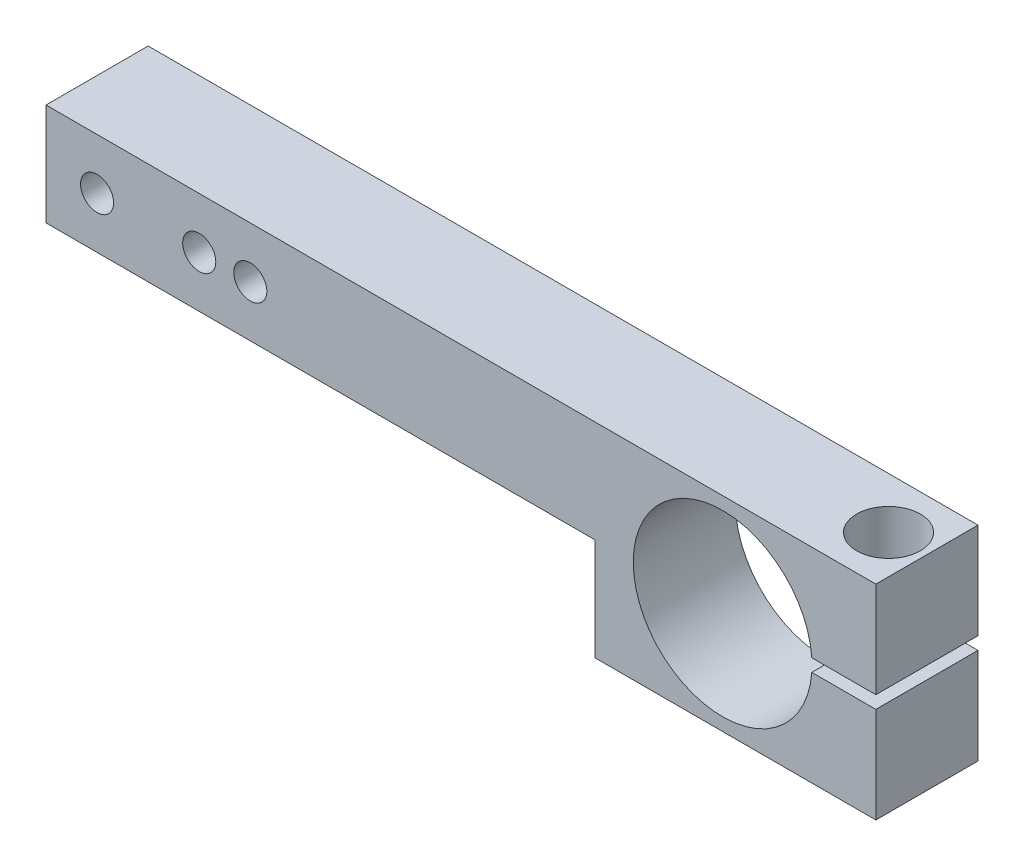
from build123d import *

# Parameters (mm, degrees)
SKETCH2_R                                       = 11.1125
SKETCH2_R_2                                     = 2.0574
BOSS_EXTRUDE1_DEPTH                             = 6.35
CBORE_FOR_10_SOCKET_HEAD_CAP_SCREW1_D           = 4.7752
CBORE_FOR_10_SOCKET_HEAD_CAP_SCREW1_CBORE_D     = 7.9248
CBORE_FOR_10_SOCKET_HEAD_CAP_SCREW1_CBORE_DEPTH = 6.35
CUT_EXTRUDE_THIN1_DEPTH                         = 86.31467913
CUT_EXTRUDE_THIN1_DEPTH_BACK                    = 86.31467913


with BuildPart() as part:
    # Sketch2 → Boss-Extrude1 (new, symmetric)
    with BuildSketch(Plane.XY):
        Polygon((19.05, 0), (19.05, 12.7), (-84.1248, 12.7), (-84.1248, 0), (-15.875, 0), (-15.875, -12.7), (19.05, -12.7), align=None)
        Circle(SKETCH2_R, mode=Mode.SUBTRACT)
        with Locations((-77.7748, 6.35)):
            Circle(SKETCH2_R_2, mode=Mode.SUBTRACT)
        with Locations((-58.7248, 6.35)):
            Circle(SKETCH2_R_2, mode=Mode.SUBTRACT)
        with Locations((-65.0748, 6.35)):
            Circle(SKETCH2_R_2, mode=Mode.SUBTRACT)
    extrude(amount=BOSS_EXTRUDE1_DEPTH, both=True)

    # CBORE for _10 Socket Head Cap Screw1 (through all)
    with Locations(Plane(origin=(0, 12.7, 0), x_dir=(1, 0, 0), z_dir=(0, 1, 0))):
        with Locations((14.2748, 0)):
            CounterBoreHole(CBORE_FOR_10_SOCKET_HEAD_CAP_SCREW1_D / 2, CBORE_FOR_10_SOCKET_HEAD_CAP_SCREW1_CBORE_D / 2, CBORE_FOR_10_SOCKET_HEAD_CAP_SCREW1_CBORE_DEPTH)

    # Sketch5 → Cut-Extrude-Thin1 (cut, two sides: drawn at the far end of the back side and taken through both)
    with BuildSketch(Plane.XY.offset(-CUT_EXTRUDE_THIN1_DEPTH_BACK)):
        Polygon((0, -0.7874), (11.1125, -0.7874), (19.05, -0.7874), (19.05, 0.7874), (11.1125, 0.7874), (0, 0.7874), align=None)
    extrude(amount=CUT_EXTRUDE_THIN1_DEPTH + CUT_EXTRUDE_THIN1_DEPTH_BACK, mode=Mode.SUBTRACT)


solid = part.part
